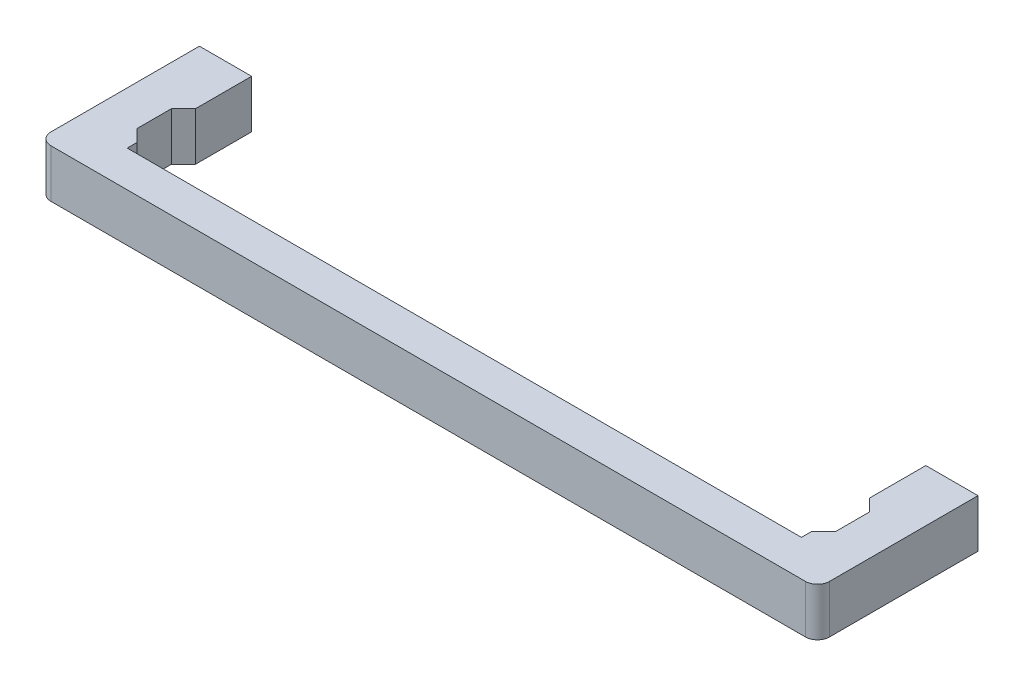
ISO-10303-21;
HEADER;
FILE_DESCRIPTION(('STEP AP214'),'2;1');
FILE_NAME('part.step','',(''),(''),'','','');
FILE_SCHEMA(('AUTOMOTIVE_DESIGN { 1 0 10303 214 1 1 1 1 }'));
ENDSEC;
DATA;
#1=APPLICATION_CONTEXT('core data for automotive mechanical design processes');
#2=APPLICATION_PROTOCOL_DEFINITION('international standard','automotive_design',2000,#1);
#3=PRODUCT_CONTEXT('',#1,'mechanical');
#4=PRODUCT('Part','Part','',(#3));
#5=PRODUCT_RELATED_PRODUCT_CATEGORY('part','',(#4));
#6=PRODUCT_DEFINITION_FORMATION('','',#4);
#7=PRODUCT_DEFINITION_CONTEXT('part definition',#1,'design');
#8=PRODUCT_DEFINITION('design','',#6,#7);
#9=PRODUCT_DEFINITION_SHAPE('','',#8);
#10=(LENGTH_UNIT() NAMED_UNIT(*) SI_UNIT(.MILLI.,.METRE.));
#11=(NAMED_UNIT(*) PLANE_ANGLE_UNIT() SI_UNIT($,.RADIAN.));
#12=(NAMED_UNIT(*) SI_UNIT($,.STERADIAN.) SOLID_ANGLE_UNIT());
#13=UNCERTAINTY_MEASURE_WITH_UNIT(LENGTH_MEASURE(1.E-05),#10,'distance_accuracy_value','');
#14=(GEOMETRIC_REPRESENTATION_CONTEXT(3) GLOBAL_UNCERTAINTY_ASSIGNED_CONTEXT((#13)) GLOBAL_UNIT_ASSIGNED_CONTEXT((#10,
#11,#12)) REPRESENTATION_CONTEXT('',''));
#15=CARTESIAN_POINT('',(0.,0.,0.));
#16=DIRECTION('',(0.,0.,1.));
#17=DIRECTION('',(1.,0.,0.));
#18=AXIS2_PLACEMENT_3D('',#15,#16,#17);
#19=CARTESIAN_POINT('',(90.,-6.,40.));
#20=DIRECTION('',(0.,0.,-1.));
#21=DIRECTION('',(0.,1.,0.));
#22=AXIS2_PLACEMENT_3D('',#19,#20,#21);
#23=PLANE('',#22);
#24=DIRECTION('',(0.,1.,0.));
#25=VECTOR('',#24,1.);
#26=CARTESIAN_POINT('',(-4.,-6.,40.));
#27=LINE('',#26,#25);
#28=CARTESIAN_POINT('',(-4.,-6.,40.));
#29=VERTEX_POINT('',#28);
#30=CARTESIAN_POINT('',(-4.,6.,40.));
#31=VERTEX_POINT('',#30);
#32=EDGE_CURVE('E9',#29,#31,#27,.T.);
#33=ORIENTED_EDGE('',*,*,#32,.F.);
#34=DIRECTION('',(-1.,0.,0.));
#35=VECTOR('',#34,1.);
#36=CARTESIAN_POINT('',(90.,-6.,40.));
#37=LINE('',#36,#35);
#38=CARTESIAN_POINT('',(184.,-6.,40.));
#39=VERTEX_POINT('',#38);
#40=EDGE_CURVE('E157',#39,#29,#37,.T.);
#41=ORIENTED_EDGE('',*,*,#40,.F.);
#42=DIRECTION('',(0.,1.,0.));
#43=VECTOR('',#42,1.);
#44=CARTESIAN_POINT('',(184.,-6.,40.));
#45=LINE('',#44,#43);
#46=CARTESIAN_POINT('',(184.,6.,40.));
#47=VERTEX_POINT('',#46);
#48=EDGE_CURVE('E155',#39,#47,#45,.T.);
#49=ORIENTED_EDGE('',*,*,#48,.T.);
#50=DIRECTION('',(-1.,0.,0.));
#51=VECTOR('',#50,1.);
#52=CARTESIAN_POINT('',(90.,6.,40.));
#53=LINE('',#52,#51);
#54=EDGE_CURVE('E141',#47,#31,#53,.T.);
#55=ORIENTED_EDGE('',*,*,#54,.T.);
#56=EDGE_LOOP('',(#33,#41,#49,#55));
#57=FACE_BOUND('',#56,.T.);
#58=ADVANCED_FACE('F14',(#57),#23,.F.);
#59=CARTESIAN_POINT('',(-4.,-6.,37.));
#60=DIRECTION('',(0.,1.,0.));
#61=DIRECTION('',(-1.,0.,0.));
#62=AXIS2_PLACEMENT_3D('',#59,#60,#61);
#63=CYLINDRICAL_SURFACE('',#62,3.);
#64=DIRECTION('',(0.,1.,0.));
#65=VECTOR('',#64,1.);
#66=CARTESIAN_POINT('',(-7.,-6.,37.));
#67=LINE('',#66,#65);
#68=CARTESIAN_POINT('',(-7.,-6.,37.));
#69=VERTEX_POINT('',#68);
#70=CARTESIAN_POINT('',(-7.,6.,37.));
#71=VERTEX_POINT('',#70);
#72=EDGE_CURVE('E22',#69,#71,#67,.T.);
#73=ORIENTED_EDGE('',*,*,#72,.F.);
#74=CARTESIAN_POINT('',(-4.,-6.,37.));
#75=DIRECTION('',(0.,-1.,0.));
#76=DIRECTION('',(1.,0.,0.));
#77=AXIS2_PLACEMENT_3D('',#74,#75,#76);
#78=CIRCLE('',#77,3.);
#79=EDGE_CURVE('E260',#29,#69,#78,.T.);
#80=ORIENTED_EDGE('',*,*,#79,.F.);
#81=ORIENTED_EDGE('',*,*,#32,.T.);
#82=CARTESIAN_POINT('',(-4.,6.,37.));
#83=DIRECTION('',(0.,-1.,0.));
#84=DIRECTION('',(1.,0.,0.));
#85=AXIS2_PLACEMENT_3D('',#82,#83,#84);
#86=CIRCLE('',#85,3.);
#87=EDGE_CURVE('E150',#31,#71,#86,.T.);
#88=ORIENTED_EDGE('',*,*,#87,.T.);
#89=EDGE_LOOP('',(#73,#80,#81,#88));
#90=FACE_BOUND('',#89,.T.);
#91=ADVANCED_FACE('F16',(#90),#63,.T.);
#92=CARTESIAN_POINT('',(-7.,-6.,37.));
#93=DIRECTION('',(1.,0.,0.));
#94=DIRECTION('',(0.,1.,0.));
#95=AXIS2_PLACEMENT_3D('',#92,#93,#94);
#96=PLANE('',#95);
#97=DIRECTION('',(0.,1.,0.));
#98=VECTOR('',#97,1.);
#99=CARTESIAN_POINT('',(-7.,-6.,0.));
#100=LINE('',#99,#98);
#101=CARTESIAN_POINT('',(-7.,-6.,0.));
#102=VERTEX_POINT('',#101);
#103=CARTESIAN_POINT('',(-7.,6.,0.));
#104=VERTEX_POINT('',#103);
#105=EDGE_CURVE('E295',#102,#104,#100,.T.);
#106=ORIENTED_EDGE('',*,*,#105,.F.);
#107=DIRECTION('',(0.,0.,-1.));
#108=VECTOR('',#107,1.);
#109=CARTESIAN_POINT('',(-7.,-6.,37.));
#110=LINE('',#109,#108);
#111=EDGE_CURVE('E263',#69,#102,#110,.T.);
#112=ORIENTED_EDGE('',*,*,#111,.F.);
#113=ORIENTED_EDGE('',*,*,#72,.T.);
#114=DIRECTION('',(0.,0.,-1.));
#115=VECTOR('',#114,1.);
#116=CARTESIAN_POINT('',(-7.,6.,37.));
#117=LINE('',#116,#115);
#118=EDGE_CURVE('E236',#71,#104,#117,.T.);
#119=ORIENTED_EDGE('',*,*,#118,.T.);
#120=EDGE_LOOP('',(#106,#112,#113,#119));
#121=FACE_BOUND('',#120,.T.);
#122=ADVANCED_FACE('F298',(#121),#96,.F.);
#123=CARTESIAN_POINT('',(-7.,-6.,0.));
#124=DIRECTION('',(0.,0.,1.));
#125=DIRECTION('',(0.,-1.,0.));
#126=AXIS2_PLACEMENT_3D('',#123,#124,#125);
#127=PLANE('',#126);
#128=CARTESIAN_POINT('',(0.,0.,0.));
#129=DIRECTION('',(0.,0.,-1.));
#130=DIRECTION('',(0.,1.,0.));
#131=AXIS2_PLACEMENT_3D('',#128,#129,#130);
#132=CIRCLE('',#131,2.5);
#133=CARTESIAN_POINT('',(0.,2.5,0.));
#134=VERTEX_POINT('',#133);
#135=EDGE_CURVE('E161',#134,#134,#132,.T.);
#136=ORIENTED_EDGE('',*,*,#135,.F.);
#137=EDGE_LOOP('',(#136));
#138=FACE_BOUND('',#137,.T.);
#139=DIRECTION('',(0.,1.,0.));
#140=VECTOR('',#139,1.);
#141=CARTESIAN_POINT('',(6.,-6.,0.));
#142=LINE('',#141,#140);
#143=CARTESIAN_POINT('',(6.,-6.,0.));
#144=VERTEX_POINT('',#143);
#145=CARTESIAN_POINT('',(6.,6.,0.));
#146=VERTEX_POINT('',#145);
#147=EDGE_CURVE('E293',#144,#146,#142,.T.);
#148=ORIENTED_EDGE('',*,*,#147,.F.);
#149=DIRECTION('',(1.,0.,0.));
#150=VECTOR('',#149,1.);
#151=CARTESIAN_POINT('',(-7.,-6.,0.));
#152=LINE('',#151,#150);
#153=EDGE_CURVE('E266',#102,#144,#152,.T.);
#154=ORIENTED_EDGE('',*,*,#153,.F.);
#155=ORIENTED_EDGE('',*,*,#105,.T.);
#156=DIRECTION('',(1.,0.,0.));
#157=VECTOR('',#156,1.);
#158=CARTESIAN_POINT('',(-7.,6.,0.));
#159=LINE('',#158,#157);
#160=EDGE_CURVE('E239',#104,#146,#159,.T.);
#161=ORIENTED_EDGE('',*,*,#160,.T.);
#162=EDGE_LOOP('',(#148,#154,#155,#161));
#163=FACE_BOUND('',#162,.T.);
#164=ADVANCED_FACE('F305',(#138,#163),#127,.F.);
#165=CARTESIAN_POINT('',(6.,-6.,0.));
#166=DIRECTION('',(-1.,0.,0.));
#167=DIRECTION('',(0.,0.,-1.));
#168=AXIS2_PLACEMENT_3D('',#165,#166,#167);
#169=PLANE('',#168);
#170=DIRECTION('',(0.,1.,0.));
#171=VECTOR('',#170,1.);
#172=CARTESIAN_POINT('',(6.,-6.,14.));
#173=LINE('',#172,#171);
#174=CARTESIAN_POINT('',(6.,-6.,14.));
#175=VERTEX_POINT('',#174);
#176=CARTESIAN_POINT('',(6.,6.,14.));
#177=VERTEX_POINT('',#176);
#178=EDGE_CURVE('E291',#175,#177,#173,.T.);
#179=ORIENTED_EDGE('',*,*,#178,.F.);
#180=DIRECTION('',(0.,0.,1.));
#181=VECTOR('',#180,1.);
#182=CARTESIAN_POINT('',(6.,-6.,0.));
#183=LINE('',#182,#181);
#184=EDGE_CURVE('E269',#144,#175,#183,.T.);
#185=ORIENTED_EDGE('',*,*,#184,.F.);
#186=ORIENTED_EDGE('',*,*,#147,.T.);
#187=DIRECTION('',(0.,0.,1.));
#188=VECTOR('',#187,1.);
#189=CARTESIAN_POINT('',(6.,6.,0.));
#190=LINE('',#189,#188);
#191=EDGE_CURVE('E242',#146,#177,#190,.T.);
#192=ORIENTED_EDGE('',*,*,#191,.T.);
#193=EDGE_LOOP('',(#179,#185,#186,#192));
#194=FACE_BOUND('',#193,.T.);
#195=ADVANCED_FACE('F351',(#194),#169,.F.);
#196=CARTESIAN_POINT('',(6.,-6.,14.));
#197=DIRECTION('',(-0.707106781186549,0.,-0.707106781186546));
#198=DIRECTION('',(0.707106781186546,0.,-0.707106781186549));
#199=AXIS2_PLACEMENT_3D('',#196,#197,#198);
#200=PLANE('',#199);
#201=DIRECTION('',(0.,1.,0.));
#202=VECTOR('',#201,1.);
#203=CARTESIAN_POINT('',(3.,-6.,17.));
#204=LINE('',#203,#202);
#205=CARTESIAN_POINT('',(3.,-6.,17.));
#206=VERTEX_POINT('',#205);
#207=CARTESIAN_POINT('',(3.,6.,17.));
#208=VERTEX_POINT('',#207);
#209=EDGE_CURVE('E289',#206,#208,#204,.T.);
#210=ORIENTED_EDGE('',*,*,#209,.F.);
#211=DIRECTION('',(-0.707106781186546,0.,0.707106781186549));
#212=VECTOR('',#211,1.);
#213=CARTESIAN_POINT('',(6.,-6.,14.));
#214=LINE('',#213,#212);
#215=EDGE_CURVE('E272',#175,#206,#214,.T.);
#216=ORIENTED_EDGE('',*,*,#215,.F.);
#217=ORIENTED_EDGE('',*,*,#178,.T.);
#218=DIRECTION('',(-0.707106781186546,0.,0.707106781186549));
#219=VECTOR('',#218,1.);
#220=CARTESIAN_POINT('',(6.,6.,14.));
#221=LINE('',#220,#219);
#222=EDGE_CURVE('E245',#177,#208,#221,.T.);
#223=ORIENTED_EDGE('',*,*,#222,.T.);
#224=EDGE_LOOP('',(#210,#216,#217,#223));
#225=FACE_BOUND('',#224,.T.);
#226=ADVANCED_FACE('F349',(#225),#200,.F.);
#227=CARTESIAN_POINT('',(3.,-6.,25.5));
#228=DIRECTION('',(1.,0.,0.));
#229=DIRECTION('',(0.,0.,1.));
#230=AXIS2_PLACEMENT_3D('',#227,#228,#229);
#231=PLANE('',#230);
#232=DIRECTION('',(0.,1.,0.));
#233=VECTOR('',#232,1.);
#234=CARTESIAN_POINT('',(3.,-6.,25.5));
#235=LINE('',#234,#233);
#236=CARTESIAN_POINT('',(3.,-6.,25.5));
#237=VERTEX_POINT('',#236);
#238=CARTESIAN_POINT('',(3.,6.,25.5));
#239=VERTEX_POINT('',#238);
#240=EDGE_CURVE('E287',#237,#239,#235,.T.);
#241=ORIENTED_EDGE('',*,*,#240,.F.);
#242=DIRECTION('',(0.,0.,-1.));
#243=VECTOR('',#242,1.);
#244=CARTESIAN_POINT('',(3.,-6.,25.5));
#245=LINE('',#244,#243);
#246=EDGE_CURVE('E275',#237,#206,#245,.T.);
#247=ORIENTED_EDGE('',*,*,#246,.T.);
#248=ORIENTED_EDGE('',*,*,#209,.T.);
#249=DIRECTION('',(0.,0.,-1.));
#250=VECTOR('',#249,1.);
#251=CARTESIAN_POINT('',(3.,6.,25.5));
#252=LINE('',#251,#250);
#253=EDGE_CURVE('E248',#239,#208,#252,.T.);
#254=ORIENTED_EDGE('',*,*,#253,.F.);
#255=EDGE_LOOP('',(#241,#247,#248,#254));
#256=FACE_BOUND('',#255,.T.);
#257=ADVANCED_FACE('F345',(#256),#231,.T.);
#258=CARTESIAN_POINT('',(6.,-6.,28.5));
#259=DIRECTION('',(0.707106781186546,0.,-0.707106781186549));
#260=DIRECTION('',(0.707106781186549,0.,0.707106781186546));
#261=AXIS2_PLACEMENT_3D('',#258,#259,#260);
#262=PLANE('',#261);
#263=DIRECTION('',(0.,1.,0.));
#264=VECTOR('',#263,1.);
#265=CARTESIAN_POINT('',(6.,-6.,28.5));
#266=LINE('',#265,#264);
#267=CARTESIAN_POINT('',(6.,-6.,28.5));
#268=VERTEX_POINT('',#267);
#269=CARTESIAN_POINT('',(6.,6.,28.5));
#270=VERTEX_POINT('',#269);
#271=EDGE_CURVE('E37',#268,#270,#266,.T.);
#272=ORIENTED_EDGE('',*,*,#271,.F.);
#273=DIRECTION('',(-0.707106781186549,0.,-0.707106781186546));
#274=VECTOR('',#273,1.);
#275=CARTESIAN_POINT('',(6.,-6.,28.5));
#276=LINE('',#275,#274);
#277=EDGE_CURVE('E278',#268,#237,#276,.T.);
#278=ORIENTED_EDGE('',*,*,#277,.T.);
#279=ORIENTED_EDGE('',*,*,#240,.T.);
#280=DIRECTION('',(-0.707106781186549,0.,-0.707106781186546));
#281=VECTOR('',#280,1.);
#282=CARTESIAN_POINT('',(6.,6.,28.5));
#283=LINE('',#282,#281);
#284=EDGE_CURVE('E251',#270,#239,#283,.T.);
#285=ORIENTED_EDGE('',*,*,#284,.F.);
#286=EDGE_LOOP('',(#272,#278,#279,#285));
#287=FACE_BOUND('',#286,.T.);
#288=ADVANCED_FACE('F342',(#287),#262,.T.);
#289=CARTESIAN_POINT('',(6.,-6.,28.5));
#290=DIRECTION('',(-1.,0.,0.));
#291=DIRECTION('',(0.,0.,-1.));
#292=AXIS2_PLACEMENT_3D('',#289,#290,#291);
#293=PLANE('',#292);
#294=DIRECTION('',(0.,1.,0.));
#295=VECTOR('',#294,1.);
#296=CARTESIAN_POINT('',(6.,-6.,31.));
#297=LINE('',#296,#295);
#298=CARTESIAN_POINT('',(6.,-6.,31.));
#299=VERTEX_POINT('',#298);
#300=CARTESIAN_POINT('',(6.,6.,31.));
#301=VERTEX_POINT('',#300);
#302=EDGE_CURVE('E29',#299,#301,#297,.T.);
#303=ORIENTED_EDGE('',*,*,#302,.F.);
#304=DIRECTION('',(0.,0.,1.));
#305=VECTOR('',#304,1.);
#306=CARTESIAN_POINT('',(6.,-6.,28.5));
#307=LINE('',#306,#305);
#308=EDGE_CURVE('E280',#268,#299,#307,.T.);
#309=ORIENTED_EDGE('',*,*,#308,.F.);
#310=ORIENTED_EDGE('',*,*,#271,.T.);
#311=DIRECTION('',(0.,0.,1.));
#312=VECTOR('',#311,1.);
#313=CARTESIAN_POINT('',(6.,6.,28.5));
#314=LINE('',#313,#312);
#315=EDGE_CURVE('E254',#270,#301,#314,.T.);
#316=ORIENTED_EDGE('',*,*,#315,.T.);
#317=EDGE_LOOP('',(#303,#309,#310,#316));
#318=FACE_BOUND('',#317,.T.);
#319=ADVANCED_FACE('F341',(#318),#293,.F.);
#320=CARTESIAN_POINT('',(90.,-6.,31.));
#321=DIRECTION('',(0.,0.,-1.));
#322=DIRECTION('',(0.,1.,0.));
#323=AXIS2_PLACEMENT_3D('',#320,#321,#322);
#324=PLANE('',#323);
#325=DIRECTION('',(-1.,0.,0.));
#326=VECTOR('',#325,1.);
#327=CARTESIAN_POINT('',(90.,6.,31.));
#328=LINE('',#327,#326);
#329=CARTESIAN_POINT('',(174.,6.,31.));
#330=VERTEX_POINT('',#329);
#331=EDGE_CURVE('E256',#330,#301,#328,.T.);
#332=ORIENTED_EDGE('',*,*,#331,.F.);
#333=DIRECTION('',(0.,1.,0.));
#334=VECTOR('',#333,1.);
#335=CARTESIAN_POINT('',(174.,-6.,31.));
#336=LINE('',#335,#334);
#337=CARTESIAN_POINT('',(174.,-6.,31.));
#338=VERTEX_POINT('',#337);
#339=EDGE_CURVE('E215',#338,#330,#336,.T.);
#340=ORIENTED_EDGE('',*,*,#339,.F.);
#341=DIRECTION('',(-1.,0.,0.));
#342=VECTOR('',#341,1.);
#343=CARTESIAN_POINT('',(90.,-6.,31.));
#344=LINE('',#343,#342);
#345=EDGE_CURVE('E282',#338,#299,#344,.T.);
#346=ORIENTED_EDGE('',*,*,#345,.T.);
#347=ORIENTED_EDGE('',*,*,#302,.T.);
#348=EDGE_LOOP('',(#332,#340,#346,#347));
#349=FACE_BOUND('',#348,.T.);
#350=ADVANCED_FACE('F340',(#349),#324,.T.);
#351=CARTESIAN_POINT('',(-4.,-6.,37.));
#352=DIRECTION('',(0.,-1.,0.));
#353=DIRECTION('',(1.,0.,0.));
#354=AXIS2_PLACEMENT_3D('',#351,#352,#353);
#355=PLANE('',#354);
#356=ORIENTED_EDGE('',*,*,#40,.T.);
#357=ORIENTED_EDGE('',*,*,#79,.T.);
#358=ORIENTED_EDGE('',*,*,#111,.T.);
#359=ORIENTED_EDGE('',*,*,#153,.T.);
#360=ORIENTED_EDGE('',*,*,#184,.T.);
#361=ORIENTED_EDGE('',*,*,#215,.T.);
#362=ORIENTED_EDGE('',*,*,#246,.F.);
#363=ORIENTED_EDGE('',*,*,#277,.F.);
#364=ORIENTED_EDGE('',*,*,#308,.T.);
#365=ORIENTED_EDGE('',*,*,#345,.F.);
#366=DIRECTION('',(0.,0.,1.));
#367=VECTOR('',#366,1.);
#368=CARTESIAN_POINT('',(174.,-6.,28.5));
#369=LINE('',#368,#367);
#370=CARTESIAN_POINT('',(174.,-6.,28.5));
#371=VERTEX_POINT('',#370);
#372=EDGE_CURVE('E212',#371,#338,#369,.T.);
#373=ORIENTED_EDGE('',*,*,#372,.F.);
#374=DIRECTION('',(0.707106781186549,0.,-0.707106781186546));
#375=VECTOR('',#374,1.);
#376=CARTESIAN_POINT('',(174.,-6.,28.5));
#377=LINE('',#376,#375);
#378=CARTESIAN_POINT('',(177.,-6.,25.5));
#379=VERTEX_POINT('',#378);
#380=EDGE_CURVE('E209',#371,#379,#377,.T.);
#381=ORIENTED_EDGE('',*,*,#380,.T.);
#382=DIRECTION('',(0.,0.,-1.));
#383=VECTOR('',#382,1.);
#384=CARTESIAN_POINT('',(177.,-6.,25.5));
#385=LINE('',#384,#383);
#386=CARTESIAN_POINT('',(177.,-6.,17.));
#387=VERTEX_POINT('',#386);
#388=EDGE_CURVE('E206',#379,#387,#385,.T.);
#389=ORIENTED_EDGE('',*,*,#388,.T.);
#390=DIRECTION('',(0.707106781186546,0.,0.707106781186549));
#391=VECTOR('',#390,1.);
#392=CARTESIAN_POINT('',(174.,-6.,14.));
#393=LINE('',#392,#391);
#394=CARTESIAN_POINT('',(174.,-6.,14.));
#395=VERTEX_POINT('',#394);
#396=EDGE_CURVE('E203',#395,#387,#393,.T.);
#397=ORIENTED_EDGE('',*,*,#396,.F.);
#398=DIRECTION('',(0.,0.,1.));
#399=VECTOR('',#398,1.);
#400=CARTESIAN_POINT('',(174.,-6.,0.));
#401=LINE('',#400,#399);
#402=CARTESIAN_POINT('',(174.,-6.,0.));
#403=VERTEX_POINT('',#402);
#404=EDGE_CURVE('E200',#403,#395,#401,.T.);
#405=ORIENTED_EDGE('',*,*,#404,.F.);
#406=DIRECTION('',(-1.,0.,0.));
#407=VECTOR('',#406,1.);
#408=CARTESIAN_POINT('',(187.,-6.,0.));
#409=LINE('',#408,#407);
#410=CARTESIAN_POINT('',(187.,-6.,0.));
#411=VERTEX_POINT('',#410);
#412=EDGE_CURVE('E197',#411,#403,#409,.T.);
#413=ORIENTED_EDGE('',*,*,#412,.F.);
#414=DIRECTION('',(0.,0.,-1.));
#415=VECTOR('',#414,1.);
#416=CARTESIAN_POINT('',(187.,-6.,37.));
#417=LINE('',#416,#415);
#418=CARTESIAN_POINT('',(187.,-6.,37.));
#419=VERTEX_POINT('',#418);
#420=EDGE_CURVE('E194',#419,#411,#417,.T.);
#421=ORIENTED_EDGE('',*,*,#420,.F.);
#422=CARTESIAN_POINT('',(184.,-6.,37.));
#423=DIRECTION('',(0.,1.,0.));
#424=DIRECTION('',(-1.,0.,0.));
#425=AXIS2_PLACEMENT_3D('',#422,#423,#424);
#426=CIRCLE('',#425,3.);
#427=EDGE_CURVE('E192',#39,#419,#426,.T.);
#428=ORIENTED_EDGE('',*,*,#427,.F.);
#429=EDGE_LOOP('',(#356,#357,#358,#359,#360,#361,#362,#363,#364,#365,#373,#381,#389,#397,#405,
#413,#421,#428));
#430=FACE_BOUND('',#429,.T.);
#431=ADVANCED_FACE('F308',(#430),#355,.T.);
#432=CARTESIAN_POINT('',(-4.,6.,37.));
#433=DIRECTION('',(0.,-1.,0.));
#434=DIRECTION('',(1.,0.,0.));
#435=AXIS2_PLACEMENT_3D('',#432,#433,#434);
#436=PLANE('',#435);
#437=ORIENTED_EDGE('',*,*,#54,.F.);
#438=CARTESIAN_POINT('',(184.,6.,37.));
#439=DIRECTION('',(0.,1.,0.));
#440=DIRECTION('',(-1.,0.,0.));
#441=AXIS2_PLACEMENT_3D('',#438,#439,#440);
#442=CIRCLE('',#441,3.);
#443=CARTESIAN_POINT('',(187.,6.,37.));
#444=VERTEX_POINT('',#443);
#445=EDGE_CURVE('E146',#47,#444,#442,.T.);
#446=ORIENTED_EDGE('',*,*,#445,.T.);
#447=DIRECTION('',(0.,0.,-1.));
#448=VECTOR('',#447,1.);
#449=CARTESIAN_POINT('',(187.,6.,37.));
#450=LINE('',#449,#448);
#451=CARTESIAN_POINT('',(187.,6.,0.));
#452=VERTEX_POINT('',#451);
#453=EDGE_CURVE('E165',#444,#452,#450,.T.);
#454=ORIENTED_EDGE('',*,*,#453,.T.);
#455=DIRECTION('',(-1.,0.,0.));
#456=VECTOR('',#455,1.);
#457=CARTESIAN_POINT('',(187.,6.,0.));
#458=LINE('',#457,#456);
#459=CARTESIAN_POINT('',(174.,6.,0.));
#460=VERTEX_POINT('',#459);
#461=EDGE_CURVE('E168',#452,#460,#458,.T.);
#462=ORIENTED_EDGE('',*,*,#461,.T.);
#463=DIRECTION('',(0.,0.,1.));
#464=VECTOR('',#463,1.);
#465=CARTESIAN_POINT('',(174.,6.,0.));
#466=LINE('',#465,#464);
#467=CARTESIAN_POINT('',(174.,6.,14.));
#468=VERTEX_POINT('',#467);
#469=EDGE_CURVE('E177',#460,#468,#466,.T.);
#470=ORIENTED_EDGE('',*,*,#469,.T.);
#471=DIRECTION('',(0.707106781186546,0.,0.707106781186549));
#472=VECTOR('',#471,1.);
#473=CARTESIAN_POINT('',(174.,6.,14.));
#474=LINE('',#473,#472);
#475=CARTESIAN_POINT('',(177.,6.,17.));
#476=VERTEX_POINT('',#475);
#477=EDGE_CURVE('E180',#468,#476,#474,.T.);
#478=ORIENTED_EDGE('',*,*,#477,.T.);
#479=DIRECTION('',(0.,0.,-1.));
#480=VECTOR('',#479,1.);
#481=CARTESIAN_POINT('',(177.,6.,25.5));
#482=LINE('',#481,#480);
#483=CARTESIAN_POINT('',(177.,6.,25.5));
#484=VERTEX_POINT('',#483);
#485=EDGE_CURVE('E183',#484,#476,#482,.T.);
#486=ORIENTED_EDGE('',*,*,#485,.F.);
#487=DIRECTION('',(0.707106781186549,0.,-0.707106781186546));
#488=VECTOR('',#487,1.);
#489=CARTESIAN_POINT('',(174.,6.,28.5));
#490=LINE('',#489,#488);
#491=CARTESIAN_POINT('',(174.,6.,28.5));
#492=VERTEX_POINT('',#491);
#493=EDGE_CURVE('E186',#492,#484,#490,.T.);
#494=ORIENTED_EDGE('',*,*,#493,.F.);
#495=DIRECTION('',(0.,0.,1.));
#496=VECTOR('',#495,1.);
#497=CARTESIAN_POINT('',(174.,6.,28.5));
#498=LINE('',#497,#496);
#499=EDGE_CURVE('E189',#492,#330,#498,.T.);
#500=ORIENTED_EDGE('',*,*,#499,.T.);
#501=ORIENTED_EDGE('',*,*,#331,.T.);
#502=ORIENTED_EDGE('',*,*,#315,.F.);
#503=ORIENTED_EDGE('',*,*,#284,.T.);
#504=ORIENTED_EDGE('',*,*,#253,.T.);
#505=ORIENTED_EDGE('',*,*,#222,.F.);
#506=ORIENTED_EDGE('',*,*,#191,.F.);
#507=ORIENTED_EDGE('',*,*,#160,.F.);
#508=ORIENTED_EDGE('',*,*,#118,.F.);
#509=ORIENTED_EDGE('',*,*,#87,.F.);
#510=EDGE_LOOP('',(#437,#446,#454,#462,#470,#478,#486,#494,#500,#501,#502,#503,#504,#505,#506,
#507,#508,#509));
#511=FACE_BOUND('',#510,.T.);
#512=ADVANCED_FACE('F143',(#511),#436,.F.);
#513=CARTESIAN_POINT('',(0.,0.,10.));
#514=DIRECTION('',(0.,0.,-1.));
#515=DIRECTION('',(0.,1.,0.));
#516=AXIS2_PLACEMENT_3D('',#513,#514,#515);
#517=CYLINDRICAL_SURFACE('',#516,2.5);
#518=CARTESIAN_POINT('',(0.,0.,10.));
#519=DIRECTION('',(0.,0.,-1.));
#520=DIRECTION('',(0.,1.,0.));
#521=AXIS2_PLACEMENT_3D('',#518,#519,#520);
#522=CIRCLE('',#521,2.5);
#523=CARTESIAN_POINT('',(0.,2.5,10.));
#524=VERTEX_POINT('',#523);
#525=EDGE_CURVE('E152',#524,#524,#522,.T.);
#526=ORIENTED_EDGE('',*,*,#525,.F.);
#527=EDGE_LOOP('',(#526));
#528=FACE_BOUND('',#527,.T.);
#529=ORIENTED_EDGE('',*,*,#135,.T.);
#530=EDGE_LOOP('',(#529));
#531=FACE_BOUND('',#530,.T.);
#532=ADVANCED_FACE('F417',(#528,#531),#517,.F.);
#533=CARTESIAN_POINT('',(0.,0.,10.));
#534=DIRECTION('',(0.,0.,-1.));
#535=DIRECTION('',(0.,1.,0.));
#536=AXIS2_PLACEMENT_3D('',#533,#534,#535);
#537=PLANE('',#536);
#538=ORIENTED_EDGE('',*,*,#525,.T.);
#539=EDGE_LOOP('',(#538));
#540=FACE_BOUND('',#539,.T.);
#541=ADVANCED_FACE('F418',(#540),#537,.T.);
#542=CARTESIAN_POINT('',(184.,-6.,37.));
#543=DIRECTION('',(0.,1.,0.));
#544=DIRECTION('',(1.,0.,0.));
#545=AXIS2_PLACEMENT_3D('',#542,#543,#544);
#546=CYLINDRICAL_SURFACE('',#545,3.);
#547=DIRECTION('',(0.,1.,0.));
#548=VECTOR('',#547,1.);
#549=CARTESIAN_POINT('',(187.,-6.,37.));
#550=LINE('',#549,#548);
#551=EDGE_CURVE('E162',#419,#444,#550,.T.);
#552=ORIENTED_EDGE('',*,*,#551,.T.);
#553=ORIENTED_EDGE('',*,*,#445,.F.);
#554=ORIENTED_EDGE('',*,*,#48,.F.);
#555=ORIENTED_EDGE('',*,*,#427,.T.);
#556=EDGE_LOOP('',(#552,#553,#554,#555));
#557=FACE_BOUND('',#556,.T.);
#558=ADVANCED_FACE('F164',(#557),#546,.T.);
#559=CARTESIAN_POINT('',(187.,-6.,37.));
#560=DIRECTION('',(-1.,0.,0.));
#561=DIRECTION('',(0.,1.,0.));
#562=AXIS2_PLACEMENT_3D('',#559,#560,#561);
#563=PLANE('',#562);
#564=DIRECTION('',(0.,1.,0.));
#565=VECTOR('',#564,1.);
#566=CARTESIAN_POINT('',(187.,-6.,0.));
#567=LINE('',#566,#565);
#568=EDGE_CURVE('E228',#411,#452,#567,.T.);
#569=ORIENTED_EDGE('',*,*,#568,.T.);
#570=ORIENTED_EDGE('',*,*,#453,.F.);
#571=ORIENTED_EDGE('',*,*,#551,.F.);
#572=ORIENTED_EDGE('',*,*,#420,.T.);
#573=EDGE_LOOP('',(#569,#570,#571,#572));
#574=FACE_BOUND('',#573,.T.);
#575=ADVANCED_FACE('F314',(#574),#563,.F.);
#576=CARTESIAN_POINT('',(187.,-6.,0.));
#577=DIRECTION('',(0.,0.,1.));
#578=DIRECTION('',(0.,-1.,0.));
#579=AXIS2_PLACEMENT_3D('',#576,#577,#578);
#580=PLANE('',#579);
#581=CARTESIAN_POINT('',(180.,0.,0.));
#582=DIRECTION('',(0.,0.,1.));
#583=DIRECTION('',(0.,1.,0.));
#584=AXIS2_PLACEMENT_3D('',#581,#582,#583);
#585=CIRCLE('',#584,2.5);
#586=CARTESIAN_POINT('',(180.,2.5,0.));
#587=VERTEX_POINT('',#586);
#588=EDGE_CURVE('E171',#587,#587,#585,.T.);
#589=ORIENTED_EDGE('',*,*,#588,.T.);
#590=EDGE_LOOP('',(#589));
#591=FACE_BOUND('',#590,.T.);
#592=DIRECTION('',(0.,1.,0.));
#593=VECTOR('',#592,1.);
#594=CARTESIAN_POINT('',(174.,-6.,0.));
#595=LINE('',#594,#593);
#596=EDGE_CURVE('E226',#403,#460,#595,.T.);
#597=ORIENTED_EDGE('',*,*,#596,.T.);
#598=ORIENTED_EDGE('',*,*,#461,.F.);
#599=ORIENTED_EDGE('',*,*,#568,.F.);
#600=ORIENTED_EDGE('',*,*,#412,.T.);
#601=EDGE_LOOP('',(#597,#598,#599,#600));
#602=FACE_BOUND('',#601,.T.);
#603=ADVANCED_FACE('F318',(#591,#602),#580,.F.);
#604=CARTESIAN_POINT('',(174.,-6.,0.));
#605=DIRECTION('',(1.,0.,0.));
#606=DIRECTION('',(0.,0.,-1.));
#607=AXIS2_PLACEMENT_3D('',#604,#605,#606);
#608=PLANE('',#607);
#609=DIRECTION('',(0.,1.,0.));
#610=VECTOR('',#609,1.);
#611=CARTESIAN_POINT('',(174.,-6.,14.));
#612=LINE('',#611,#610);
#613=EDGE_CURVE('E224',#395,#468,#612,.T.);
#614=ORIENTED_EDGE('',*,*,#613,.T.);
#615=ORIENTED_EDGE('',*,*,#469,.F.);
#616=ORIENTED_EDGE('',*,*,#596,.F.);
#617=ORIENTED_EDGE('',*,*,#404,.T.);
#618=EDGE_LOOP('',(#614,#615,#616,#617));
#619=FACE_BOUND('',#618,.T.);
#620=ADVANCED_FACE('F320',(#619),#608,.F.);
#621=CARTESIAN_POINT('',(174.,-6.,14.));
#622=DIRECTION('',(0.707106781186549,0.,-0.707106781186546));
#623=DIRECTION('',(-0.707106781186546,0.,-0.707106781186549));
#624=AXIS2_PLACEMENT_3D('',#621,#622,#623);
#625=PLANE('',#624);
#626=DIRECTION('',(0.,1.,0.));
#627=VECTOR('',#626,1.);
#628=CARTESIAN_POINT('',(177.,-6.,17.));
#629=LINE('',#628,#627);
#630=EDGE_CURVE('E222',#387,#476,#629,.T.);
#631=ORIENTED_EDGE('',*,*,#630,.T.);
#632=ORIENTED_EDGE('',*,*,#477,.F.);
#633=ORIENTED_EDGE('',*,*,#613,.F.);
#634=ORIENTED_EDGE('',*,*,#396,.T.);
#635=EDGE_LOOP('',(#631,#632,#633,#634));
#636=FACE_BOUND('',#635,.T.);
#637=ADVANCED_FACE('F325',(#636),#625,.F.);
#638=CARTESIAN_POINT('',(177.,-6.,25.5));
#639=DIRECTION('',(-1.,0.,0.));
#640=DIRECTION('',(0.,0.,1.));
#641=AXIS2_PLACEMENT_3D('',#638,#639,#640);
#642=PLANE('',#641);
#643=DIRECTION('',(0.,1.,0.));
#644=VECTOR('',#643,1.);
#645=CARTESIAN_POINT('',(177.,-6.,25.5));
#646=LINE('',#645,#644);
#647=EDGE_CURVE('E220',#379,#484,#646,.T.);
#648=ORIENTED_EDGE('',*,*,#647,.T.);
#649=ORIENTED_EDGE('',*,*,#485,.T.);
#650=ORIENTED_EDGE('',*,*,#630,.F.);
#651=ORIENTED_EDGE('',*,*,#388,.F.);
#652=EDGE_LOOP('',(#648,#649,#650,#651));
#653=FACE_BOUND('',#652,.T.);
#654=ADVANCED_FACE('F328',(#653),#642,.T.);
#655=CARTESIAN_POINT('',(174.,-6.,28.5));
#656=DIRECTION('',(-0.707106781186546,0.,-0.707106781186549));
#657=DIRECTION('',(-0.707106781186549,0.,0.707106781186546));
#658=AXIS2_PLACEMENT_3D('',#655,#656,#657);
#659=PLANE('',#658);
#660=DIRECTION('',(0.,1.,0.));
#661=VECTOR('',#660,1.);
#662=CARTESIAN_POINT('',(174.,-6.,28.5));
#663=LINE('',#662,#661);
#664=EDGE_CURVE('E218',#371,#492,#663,.T.);
#665=ORIENTED_EDGE('',*,*,#664,.T.);
#666=ORIENTED_EDGE('',*,*,#493,.T.);
#667=ORIENTED_EDGE('',*,*,#647,.F.);
#668=ORIENTED_EDGE('',*,*,#380,.F.);
#669=EDGE_LOOP('',(#665,#666,#667,#668));
#670=FACE_BOUND('',#669,.T.);
#671=ADVANCED_FACE('F332',(#670),#659,.T.);
#672=CARTESIAN_POINT('',(174.,-6.,28.5));
#673=DIRECTION('',(1.,0.,0.));
#674=DIRECTION('',(0.,0.,-1.));
#675=AXIS2_PLACEMENT_3D('',#672,#673,#674);
#676=PLANE('',#675);
#677=ORIENTED_EDGE('',*,*,#339,.T.);
#678=ORIENTED_EDGE('',*,*,#499,.F.);
#679=ORIENTED_EDGE('',*,*,#664,.F.);
#680=ORIENTED_EDGE('',*,*,#372,.T.);
#681=EDGE_LOOP('',(#677,#678,#679,#680));
#682=FACE_BOUND('',#681,.T.);
#683=ADVANCED_FACE('F336',(#682),#676,.F.);
#684=CARTESIAN_POINT('',(180.,0.,10.));
#685=DIRECTION('',(0.,0.,-1.));
#686=DIRECTION('',(0.,1.,0.));
#687=AXIS2_PLACEMENT_3D('',#684,#685,#686);
#688=CYLINDRICAL_SURFACE('',#687,2.5);
#689=CARTESIAN_POINT('',(180.,0.,10.));
#690=DIRECTION('',(0.,0.,1.));
#691=DIRECTION('',(0.,1.,0.));
#692=AXIS2_PLACEMENT_3D('',#689,#690,#691);
#693=CIRCLE('',#692,2.5);
#694=CARTESIAN_POINT('',(180.,2.5,10.));
#695=VERTEX_POINT('',#694);
#696=EDGE_CURVE('E166',#695,#695,#693,.T.);
#697=ORIENTED_EDGE('',*,*,#696,.T.);
#698=EDGE_LOOP('',(#697));
#699=FACE_BOUND('',#698,.T.);
#700=ORIENTED_EDGE('',*,*,#588,.F.);
#701=EDGE_LOOP('',(#700));
#702=FACE_BOUND('',#701,.T.);
#703=ADVANCED_FACE('F491',(#699,#702),#688,.F.);
#704=CARTESIAN_POINT('',(180.,0.,10.));
#705=DIRECTION('',(0.,0.,-1.));
#706=DIRECTION('',(0.,1.,0.));
#707=AXIS2_PLACEMENT_3D('',#704,#705,#706);
#708=PLANE('',#707);
#709=ORIENTED_EDGE('',*,*,#696,.F.);
#710=EDGE_LOOP('',(#709));
#711=FACE_BOUND('',#710,.T.);
#712=ADVANCED_FACE('F493',(#711),#708,.T.);
#713=CLOSED_SHELL('',(#58,#91,#122,#164,#195,#226,#257,#288,#319,#350,#431,#512,#532,#541,#558,
#575,#603,#620,#637,#654,#671,#683,#703,#712));
#714=MANIFOLD_SOLID_BREP('B1',#713);
#715=ADVANCED_BREP_SHAPE_REPRESENTATION('',(#18,#714),#14);
#716=SHAPE_DEFINITION_REPRESENTATION(#9,#715);
ENDSEC;
END-ISO-10303-21;
